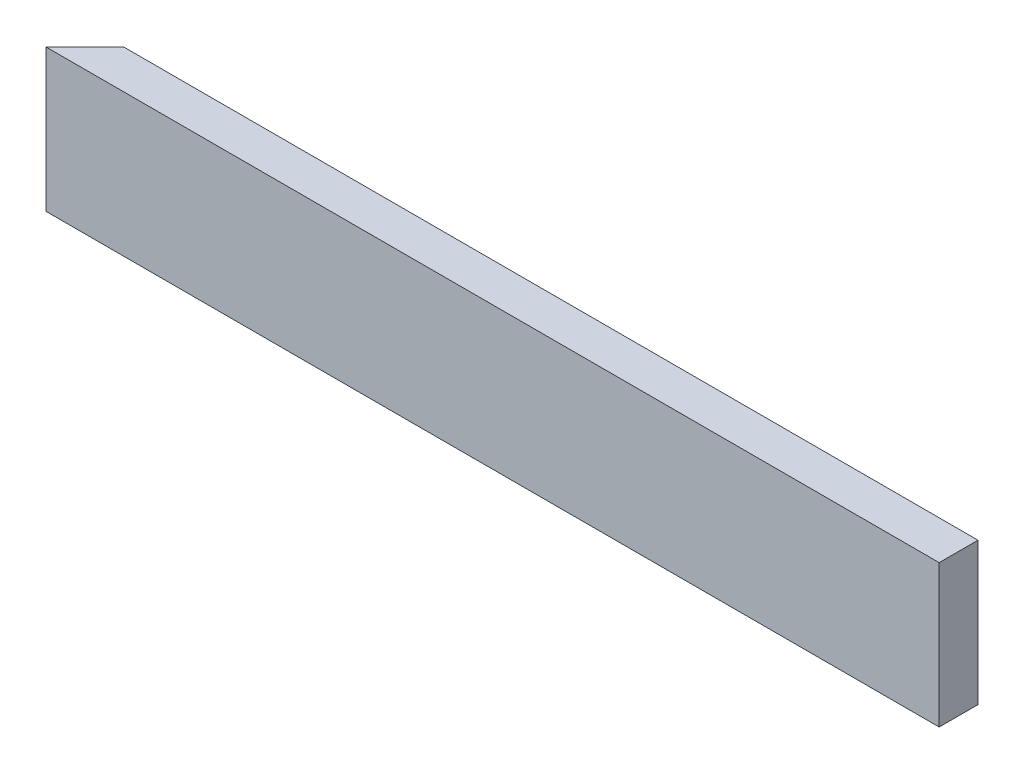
ISO-10303-21;
HEADER;
FILE_DESCRIPTION(('STEP AP214'),'2;1');
FILE_NAME('part.step','',(''),(''),'','','');
FILE_SCHEMA(('AUTOMOTIVE_DESIGN { 1 0 10303 214 1 1 1 1 }'));
ENDSEC;
DATA;
#1=APPLICATION_CONTEXT('core data for automotive mechanical design processes');
#2=APPLICATION_PROTOCOL_DEFINITION('international standard','automotive_design',2000,#1);
#3=PRODUCT_CONTEXT('',#1,'mechanical');
#4=PRODUCT('Part','Part','',(#3));
#5=PRODUCT_RELATED_PRODUCT_CATEGORY('part','',(#4));
#6=PRODUCT_DEFINITION_FORMATION('','',#4);
#7=PRODUCT_DEFINITION_CONTEXT('part definition',#1,'design');
#8=PRODUCT_DEFINITION('design','',#6,#7);
#9=PRODUCT_DEFINITION_SHAPE('','',#8);
#10=(LENGTH_UNIT() NAMED_UNIT(*) SI_UNIT(.MILLI.,.METRE.));
#11=(NAMED_UNIT(*) PLANE_ANGLE_UNIT() SI_UNIT($,.RADIAN.));
#12=(NAMED_UNIT(*) SI_UNIT($,.STERADIAN.) SOLID_ANGLE_UNIT());
#13=UNCERTAINTY_MEASURE_WITH_UNIT(LENGTH_MEASURE(1.E-05),#10,'distance_accuracy_value','');
#14=(GEOMETRIC_REPRESENTATION_CONTEXT(3) GLOBAL_UNCERTAINTY_ASSIGNED_CONTEXT((#13)) GLOBAL_UNIT_ASSIGNED_CONTEXT((#10,
#11,#12)) REPRESENTATION_CONTEXT('',''));
#15=CARTESIAN_POINT('',(0.,0.,0.));
#16=DIRECTION('',(0.,0.,1.));
#17=DIRECTION('',(1.,0.,0.));
#18=AXIS2_PLACEMENT_3D('',#15,#16,#17);
#19=CARTESIAN_POINT('',(-838.199999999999,139.7,0.));
#20=DIRECTION('',(0.,0.,1.));
#21=DIRECTION('',(1.,0.,0.));
#22=AXIS2_PLACEMENT_3D('',#19,#20,#21);
#23=PLANE('',#22);
#24=DIRECTION('',(-1.,0.,0.));
#25=VECTOR('',#24,1.);
#26=CARTESIAN_POINT('',(-838.199999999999,0.,0.));
#27=LINE('',#26,#25);
#28=CARTESIAN_POINT('',(0.,0.,0.));
#29=VERTEX_POINT('',#28);
#30=CARTESIAN_POINT('',(-838.199999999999,0.,0.));
#31=VERTEX_POINT('',#30);
#32=EDGE_CURVE('E102',#29,#31,#27,.T.);
#33=ORIENTED_EDGE('',*,*,#32,.T.);
#34=DIRECTION('',(0.,-1.,0.));
#35=VECTOR('',#34,1.);
#36=CARTESIAN_POINT('',(-838.199999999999,139.7,0.));
#37=LINE('',#36,#35);
#38=CARTESIAN_POINT('',(-838.199999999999,139.7,0.));
#39=VERTEX_POINT('',#38);
#40=EDGE_CURVE('E11',#39,#31,#37,.T.);
#41=ORIENTED_EDGE('',*,*,#40,.F.);
#42=DIRECTION('',(-1.,0.,0.));
#43=VECTOR('',#42,1.);
#44=CARTESIAN_POINT('',(-838.199999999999,139.7,0.));
#45=LINE('',#44,#43);
#46=CARTESIAN_POINT('',(0.,139.7,0.));
#47=VERTEX_POINT('',#46);
#48=EDGE_CURVE('E90',#47,#39,#45,.T.);
#49=ORIENTED_EDGE('',*,*,#48,.F.);
#50=DIRECTION('',(0.,-1.,0.));
#51=VECTOR('',#50,1.);
#52=CARTESIAN_POINT('',(0.,139.7,0.));
#53=LINE('',#52,#51);
#54=EDGE_CURVE('E98',#47,#29,#53,.T.);
#55=ORIENTED_EDGE('',*,*,#54,.T.);
#56=EDGE_LOOP('',(#33,#41,#49,#55));
#57=FACE_BOUND('',#56,.T.);
#58=ADVANCED_FACE('F39',(#57),#23,.F.);
#59=CARTESIAN_POINT('',(-876.3,139.7,38.1000000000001));
#60=DIRECTION('',(0.707106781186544,0.,0.707106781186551));
#61=DIRECTION('',(0.707106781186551,0.,-0.707106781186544));
#62=AXIS2_PLACEMENT_3D('',#59,#60,#61);
#63=PLANE('',#62);
#64=DIRECTION('',(-0.707106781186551,0.,0.707106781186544));
#65=VECTOR('',#64,1.);
#66=CARTESIAN_POINT('',(-876.3,0.,38.1000000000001));
#67=LINE('',#66,#65);
#68=CARTESIAN_POINT('',(-876.3,0.,38.1000000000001));
#69=VERTEX_POINT('',#68);
#70=EDGE_CURVE('E94',#31,#69,#67,.T.);
#71=ORIENTED_EDGE('',*,*,#70,.T.);
#72=DIRECTION('',(0.,-1.,0.));
#73=VECTOR('',#72,1.);
#74=CARTESIAN_POINT('',(-876.3,139.7,38.1000000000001));
#75=LINE('',#74,#73);
#76=CARTESIAN_POINT('',(-876.3,139.7,38.1000000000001));
#77=VERTEX_POINT('',#76);
#78=EDGE_CURVE('E47',#77,#69,#75,.T.);
#79=ORIENTED_EDGE('',*,*,#78,.F.);
#80=DIRECTION('',(-0.707106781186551,0.,0.707106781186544));
#81=VECTOR('',#80,1.);
#82=CARTESIAN_POINT('',(-876.3,139.7,38.1000000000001));
#83=LINE('',#82,#81);
#84=EDGE_CURVE('E85',#39,#77,#83,.T.);
#85=ORIENTED_EDGE('',*,*,#84,.F.);
#86=ORIENTED_EDGE('',*,*,#40,.T.);
#87=EDGE_LOOP('',(#71,#79,#85,#86));
#88=FACE_BOUND('',#87,.T.);
#89=ADVANCED_FACE('F93',(#88),#63,.F.);
#90=CARTESIAN_POINT('',(0.,139.7,38.1));
#91=DIRECTION('',(0.,0.,-1.));
#92=DIRECTION('',(-1.,0.,0.));
#93=AXIS2_PLACEMENT_3D('',#90,#91,#92);
#94=PLANE('',#93);
#95=DIRECTION('',(1.,0.,0.));
#96=VECTOR('',#95,1.);
#97=CARTESIAN_POINT('',(0.,0.,38.1));
#98=LINE('',#97,#96);
#99=CARTESIAN_POINT('',(0.,0.,38.1));
#100=VERTEX_POINT('',#99);
#101=EDGE_CURVE('E72',#69,#100,#98,.T.);
#102=ORIENTED_EDGE('',*,*,#101,.T.);
#103=DIRECTION('',(0.,-1.,0.));
#104=VECTOR('',#103,1.);
#105=CARTESIAN_POINT('',(0.,139.7,38.1));
#106=LINE('',#105,#104);
#107=CARTESIAN_POINT('',(0.,139.7,38.1));
#108=VERTEX_POINT('',#107);
#109=EDGE_CURVE('E95',#108,#100,#106,.T.);
#110=ORIENTED_EDGE('',*,*,#109,.F.);
#111=DIRECTION('',(1.,0.,0.));
#112=VECTOR('',#111,1.);
#113=CARTESIAN_POINT('',(0.,139.7,38.1));
#114=LINE('',#113,#112);
#115=EDGE_CURVE('E88',#77,#108,#114,.T.);
#116=ORIENTED_EDGE('',*,*,#115,.F.);
#117=ORIENTED_EDGE('',*,*,#78,.T.);
#118=EDGE_LOOP('',(#102,#110,#116,#117));
#119=FACE_BOUND('',#118,.T.);
#120=ADVANCED_FACE('F96',(#119),#94,.F.);
#121=CARTESIAN_POINT('',(0.,139.7,0.));
#122=DIRECTION('',(-1.,0.,0.));
#123=DIRECTION('',(0.,0.,1.));
#124=AXIS2_PLACEMENT_3D('',#121,#122,#123);
#125=PLANE('',#124);
#126=DIRECTION('',(0.,0.,-1.));
#127=VECTOR('',#126,1.);
#128=CARTESIAN_POINT('',(0.,0.,0.));
#129=LINE('',#128,#127);
#130=EDGE_CURVE('E78',#100,#29,#129,.T.);
#131=ORIENTED_EDGE('',*,*,#130,.T.);
#132=ORIENTED_EDGE('',*,*,#54,.F.);
#133=DIRECTION('',(0.,0.,-1.));
#134=VECTOR('',#133,1.);
#135=CARTESIAN_POINT('',(0.,139.7,0.));
#136=LINE('',#135,#134);
#137=EDGE_CURVE('E55',#108,#47,#136,.T.);
#138=ORIENTED_EDGE('',*,*,#137,.F.);
#139=ORIENTED_EDGE('',*,*,#109,.T.);
#140=EDGE_LOOP('',(#131,#132,#138,#139));
#141=FACE_BOUND('',#140,.T.);
#142=ADVANCED_FACE('F109',(#141),#125,.F.);
#143=CARTESIAN_POINT('',(0.,139.7,0.));
#144=DIRECTION('',(0.,-1.,0.));
#145=DIRECTION('',(0.,0.,-1.));
#146=AXIS2_PLACEMENT_3D('',#143,#144,#145);
#147=PLANE('',#146);
#148=ORIENTED_EDGE('',*,*,#48,.T.);
#149=ORIENTED_EDGE('',*,*,#84,.T.);
#150=ORIENTED_EDGE('',*,*,#115,.T.);
#151=ORIENTED_EDGE('',*,*,#137,.T.);
#152=EDGE_LOOP('',(#148,#149,#150,#151));
#153=FACE_BOUND('',#152,.T.);
#154=ADVANCED_FACE('F86',(#153),#147,.F.);
#155=CARTESIAN_POINT('',(0.,0.,0.));
#156=DIRECTION('',(0.,-1.,0.));
#157=DIRECTION('',(0.,0.,-1.));
#158=AXIS2_PLACEMENT_3D('',#155,#156,#157);
#159=PLANE('',#158);
#160=ORIENTED_EDGE('',*,*,#32,.F.);
#161=ORIENTED_EDGE('',*,*,#130,.F.);
#162=ORIENTED_EDGE('',*,*,#101,.F.);
#163=ORIENTED_EDGE('',*,*,#70,.F.);
#164=EDGE_LOOP('',(#160,#161,#162,#163));
#165=FACE_BOUND('',#164,.T.);
#166=ADVANCED_FACE('F112',(#165),#159,.T.);
#167=CLOSED_SHELL('',(#58,#89,#120,#142,#154,#166));
#168=MANIFOLD_SOLID_BREP('B2',#167);
#169=ADVANCED_BREP_SHAPE_REPRESENTATION('',(#18,#168),#14);
#170=SHAPE_DEFINITION_REPRESENTATION(#9,#169);
ENDSEC;
END-ISO-10303-21;
